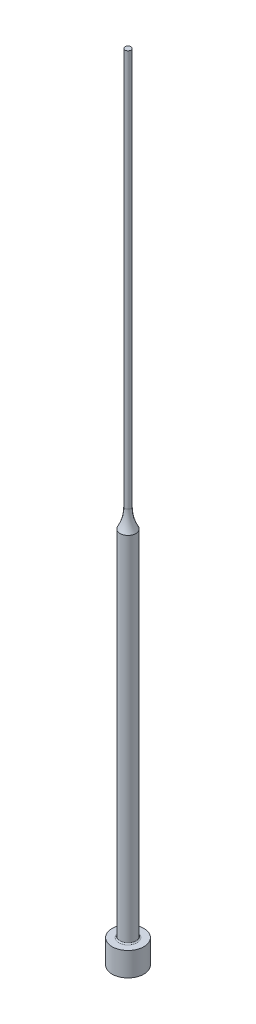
ISO-10303-21;
HEADER;
FILE_DESCRIPTION(('STEP AP214'),'2;1');
FILE_NAME('part.step','',(''),(''),'','','');
FILE_SCHEMA(('AUTOMOTIVE_DESIGN { 1 0 10303 214 1 1 1 1 }'));
ENDSEC;
DATA;
#1=APPLICATION_CONTEXT('core data for automotive mechanical design processes');
#2=APPLICATION_PROTOCOL_DEFINITION('international standard','automotive_design',2000,#1);
#3=PRODUCT_CONTEXT('',#1,'mechanical');
#4=PRODUCT('Part','Part','',(#3));
#5=PRODUCT_RELATED_PRODUCT_CATEGORY('part','',(#4));
#6=PRODUCT_DEFINITION_FORMATION('','',#4);
#7=PRODUCT_DEFINITION_CONTEXT('part definition',#1,'design');
#8=PRODUCT_DEFINITION('design','',#6,#7);
#9=PRODUCT_DEFINITION_SHAPE('','',#8);
#10=(LENGTH_UNIT() NAMED_UNIT(*) SI_UNIT(.MILLI.,.METRE.));
#11=(NAMED_UNIT(*) PLANE_ANGLE_UNIT() SI_UNIT($,.RADIAN.));
#12=(NAMED_UNIT(*) SI_UNIT($,.STERADIAN.) SOLID_ANGLE_UNIT());
#13=UNCERTAINTY_MEASURE_WITH_UNIT(LENGTH_MEASURE(1.E-05),#10,'distance_accuracy_value','');
#14=(GEOMETRIC_REPRESENTATION_CONTEXT(3) GLOBAL_UNCERTAINTY_ASSIGNED_CONTEXT((#13)) GLOBAL_UNIT_ASSIGNED_CONTEXT((#10,
#11,#12)) REPRESENTATION_CONTEXT('',''));
#15=CARTESIAN_POINT('',(0.,0.,0.));
#16=DIRECTION('',(0.,0.,1.));
#17=DIRECTION('',(1.,0.,0.));
#18=AXIS2_PLACEMENT_3D('',#15,#16,#17);
#19=CARTESIAN_POINT('',(0.750000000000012,200.,0.));
#20=DIRECTION('',(0.,-1.,0.));
#21=DIRECTION('',(1.,0.,0.));
#22=AXIS2_PLACEMENT_3D('',#19,#20,#21);
#23=PLANE('',#22);
#24=CARTESIAN_POINT('',(0.,200.,0.));
#25=DIRECTION('',(0.,1.,0.));
#26=DIRECTION('',(-1.,0.,0.));
#27=AXIS2_PLACEMENT_3D('',#24,#25,#26);
#28=CIRCLE('',#27,0.750000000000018);
#29=CARTESIAN_POINT('',(-0.750000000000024,200.,0.));
#30=VERTEX_POINT('',#29);
#31=EDGE_CURVE('E10',#30,#30,#28,.T.);
#32=ORIENTED_EDGE('',*,*,#31,.T.);
#33=EDGE_LOOP('',(#32));
#34=FACE_BOUND('',#33,.T.);
#35=ADVANCED_FACE('F30',(#34),#23,.F.);
#36=CARTESIAN_POINT('',(0.,200.,0.));
#37=DIRECTION('',(0.,1.,0.));
#38=DIRECTION('',(-1.,0.,0.));
#39=AXIS2_PLACEMENT_3D('',#36,#37,#38);
#40=CYLINDRICAL_SURFACE('',#39,0.75000000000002);
#41=ORIENTED_EDGE('',*,*,#31,.F.);
#42=EDGE_LOOP('',(#41));
#43=FACE_BOUND('',#42,.T.);
#44=CARTESIAN_POINT('',(0.,100.,0.));
#45=DIRECTION('',(0.,1.,0.));
#46=DIRECTION('',(-1.,0.,0.));
#47=AXIS2_PLACEMENT_3D('',#44,#45,#46);
#48=CIRCLE('',#47,0.750000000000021);
#49=CARTESIAN_POINT('',(-0.750000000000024,100.,0.));
#50=VERTEX_POINT('',#49);
#51=EDGE_CURVE('E36',#50,#50,#48,.T.);
#52=ORIENTED_EDGE('',*,*,#51,.T.);
#53=EDGE_LOOP('',(#52));
#54=FACE_BOUND('',#53,.T.);
#55=ADVANCED_FACE('F71',(#43,#54),#40,.T.);
#56=CARTESIAN_POINT('',(0.,100.,0.));
#57=DIRECTION('',(0.,1.,0.));
#58=DIRECTION('',(-1.,0.,0.));
#59=AXIS2_PLACEMENT_3D('',#56,#57,#58);
#60=TOROIDAL_SURFACE('',#59,10.75,10.);
#61=ORIENTED_EDGE('',*,*,#51,.F.);
#62=EDGE_LOOP('',(#61));
#63=FACE_BOUND('',#62,.T.);
#64=CARTESIAN_POINT('',(0.,95.1587708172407,0.));
#65=DIRECTION('',(0.,1.,0.));
#66=DIRECTION('',(-1.,0.,0.));
#67=AXIS2_PLACEMENT_3D('',#64,#65,#66);
#68=CIRCLE('',#67,2.00000000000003);
#69=CARTESIAN_POINT('',(-2.00000000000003,95.1587708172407,0.));
#70=VERTEX_POINT('',#69);
#71=EDGE_CURVE('E40',#70,#70,#68,.T.);
#72=ORIENTED_EDGE('',*,*,#71,.T.);
#73=EDGE_LOOP('',(#72));
#74=FACE_BOUND('',#73,.T.);
#75=ADVANCED_FACE('F75',(#63,#74),#60,.F.);
#76=CARTESIAN_POINT('',(0.,200.,0.));
#77=DIRECTION('',(0.,1.,0.));
#78=DIRECTION('',(-1.,0.,0.));
#79=AXIS2_PLACEMENT_3D('',#76,#77,#78);
#80=CYLINDRICAL_SURFACE('',#79,2.00000000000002);
#81=ORIENTED_EDGE('',*,*,#71,.F.);
#82=EDGE_LOOP('',(#81));
#83=FACE_BOUND('',#82,.T.);
#84=CARTESIAN_POINT('',(0.,6.3,0.));
#85=DIRECTION('',(0.,1.,0.));
#86=DIRECTION('',(-1.,0.,0.));
#87=AXIS2_PLACEMENT_3D('',#84,#85,#86);
#88=CIRCLE('',#87,2.00000000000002);
#89=CARTESIAN_POINT('',(-2.00000000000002,6.3,0.));
#90=VERTEX_POINT('',#89);
#91=EDGE_CURVE('E44',#90,#90,#88,.T.);
#92=ORIENTED_EDGE('',*,*,#91,.T.);
#93=EDGE_LOOP('',(#92));
#94=FACE_BOUND('',#93,.T.);
#95=ADVANCED_FACE('F80',(#83,#94),#80,.T.);
#96=CARTESIAN_POINT('',(0.,6.3,0.));
#97=DIRECTION('',(0.,1.,0.));
#98=DIRECTION('',(-1.,0.,0.));
#99=AXIS2_PLACEMENT_3D('',#96,#97,#98);
#100=TOROIDAL_SURFACE('',#99,2.30000000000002,0.3);
#101=ORIENTED_EDGE('',*,*,#91,.F.);
#102=EDGE_LOOP('',(#101));
#103=FACE_BOUND('',#102,.T.);
#104=CARTESIAN_POINT('',(0.,6.00000000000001,0.));
#105=DIRECTION('',(0.,1.,0.));
#106=DIRECTION('',(-1.,0.,0.));
#107=AXIS2_PLACEMENT_3D('',#104,#105,#106);
#108=CIRCLE('',#107,2.30000000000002);
#109=CARTESIAN_POINT('',(-2.30000000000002,6.00000000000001,0.));
#110=VERTEX_POINT('',#109);
#111=EDGE_CURVE('E49',#110,#110,#108,.T.);
#112=ORIENTED_EDGE('',*,*,#111,.T.);
#113=EDGE_LOOP('',(#112));
#114=FACE_BOUND('',#113,.T.);
#115=ADVANCED_FACE('F86',(#103,#114),#100,.F.);
#116=CARTESIAN_POINT('',(4.00000000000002,6.,0.));
#117=DIRECTION('',(0.,-1.,0.));
#118=DIRECTION('',(1.,0.,0.));
#119=AXIS2_PLACEMENT_3D('',#116,#117,#118);
#120=PLANE('',#119);
#121=ORIENTED_EDGE('',*,*,#111,.F.);
#122=EDGE_LOOP('',(#121));
#123=FACE_BOUND('',#122,.T.);
#124=CARTESIAN_POINT('',(0.,6.00000000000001,0.));
#125=DIRECTION('',(0.,1.,0.));
#126=DIRECTION('',(-1.,0.,0.));
#127=AXIS2_PLACEMENT_3D('',#124,#125,#126);
#128=CIRCLE('',#127,4.00000000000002);
#129=CARTESIAN_POINT('',(-4.00000000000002,6.00000000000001,0.));
#130=VERTEX_POINT('',#129);
#131=EDGE_CURVE('E52',#130,#130,#128,.T.);
#132=ORIENTED_EDGE('',*,*,#131,.T.);
#133=EDGE_LOOP('',(#132));
#134=FACE_BOUND('',#133,.T.);
#135=ADVANCED_FACE('F67',(#123,#134),#120,.F.);
#136=CARTESIAN_POINT('',(0.,200.,0.));
#137=DIRECTION('',(0.,1.,0.));
#138=DIRECTION('',(-1.,0.,0.));
#139=AXIS2_PLACEMENT_3D('',#136,#137,#138);
#140=CYLINDRICAL_SURFACE('',#139,4.00000000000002);
#141=ORIENTED_EDGE('',*,*,#131,.F.);
#142=EDGE_LOOP('',(#141));
#143=FACE_BOUND('',#142,.T.);
#144=CARTESIAN_POINT('',(0.,0.,0.));
#145=DIRECTION('',(0.,1.,0.));
#146=DIRECTION('',(-1.,0.,0.));
#147=AXIS2_PLACEMENT_3D('',#144,#145,#146);
#148=CIRCLE('',#147,4.00000000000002);
#149=CARTESIAN_POINT('',(-4.00000000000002,0.,0.));
#150=VERTEX_POINT('',#149);
#151=EDGE_CURVE('E55',#150,#150,#148,.T.);
#152=ORIENTED_EDGE('',*,*,#151,.T.);
#153=EDGE_LOOP('',(#152));
#154=FACE_BOUND('',#153,.T.);
#155=ADVANCED_FACE('F59',(#143,#154),#140,.T.);
#156=CARTESIAN_POINT('',(0.,0.,0.));
#157=DIRECTION('',(0.,1.,0.));
#158=DIRECTION('',(-1.,0.,0.));
#159=AXIS2_PLACEMENT_3D('',#156,#157,#158);
#160=PLANE('',#159);
#161=ORIENTED_EDGE('',*,*,#151,.F.);
#162=EDGE_LOOP('',(#161));
#163=FACE_BOUND('',#162,.T.);
#164=ADVANCED_FACE('F61',(#163),#160,.F.);
#165=CLOSED_SHELL('',(#35,#55,#75,#95,#115,#135,#155,#164));
#166=MANIFOLD_SOLID_BREP('B2',#165);
#167=ADVANCED_BREP_SHAPE_REPRESENTATION('',(#18,#166),#14);
#168=SHAPE_DEFINITION_REPRESENTATION(#9,#167);
ENDSEC;
END-ISO-10303-21;
